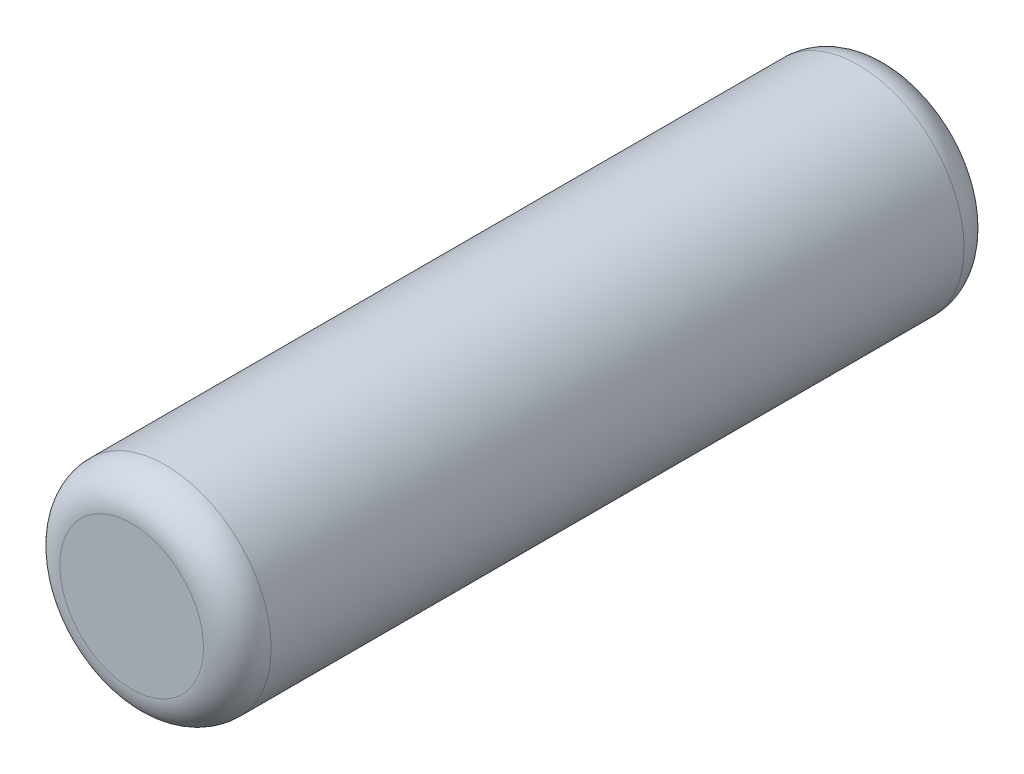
ISO-10303-21;
HEADER;
FILE_DESCRIPTION(('STEP AP214'),'2;1');
FILE_NAME('part.step','',(''),(''),'','','');
FILE_SCHEMA(('AUTOMOTIVE_DESIGN { 1 0 10303 214 1 1 1 1 }'));
ENDSEC;
DATA;
#1=APPLICATION_CONTEXT('core data for automotive mechanical design processes');
#2=APPLICATION_PROTOCOL_DEFINITION('international standard','automotive_design',2000,#1);
#3=PRODUCT_CONTEXT('',#1,'mechanical');
#4=PRODUCT('Part','Part','',(#3));
#5=PRODUCT_RELATED_PRODUCT_CATEGORY('part','',(#4));
#6=PRODUCT_DEFINITION_FORMATION('','',#4);
#7=PRODUCT_DEFINITION_CONTEXT('part definition',#1,'design');
#8=PRODUCT_DEFINITION('design','',#6,#7);
#9=PRODUCT_DEFINITION_SHAPE('','',#8);
#10=(LENGTH_UNIT() NAMED_UNIT(*) SI_UNIT(.MILLI.,.METRE.));
#11=(NAMED_UNIT(*) PLANE_ANGLE_UNIT() SI_UNIT($,.RADIAN.));
#12=(NAMED_UNIT(*) SI_UNIT($,.STERADIAN.) SOLID_ANGLE_UNIT());
#13=UNCERTAINTY_MEASURE_WITH_UNIT(LENGTH_MEASURE(1.E-05),#10,'distance_accuracy_value','');
#14=(GEOMETRIC_REPRESENTATION_CONTEXT(3) GLOBAL_UNCERTAINTY_ASSIGNED_CONTEXT((#13)) GLOBAL_UNIT_ASSIGNED_CONTEXT((#10,
#11,#12)) REPRESENTATION_CONTEXT('',''));
#15=CARTESIAN_POINT('',(0.,0.,0.));
#16=DIRECTION('',(0.,0.,1.));
#17=DIRECTION('',(1.,0.,0.));
#18=AXIS2_PLACEMENT_3D('',#15,#16,#17);
#19=CARTESIAN_POINT('',(0.,0.,-8.6));
#20=DIRECTION('',(0.,0.,1.));
#21=DIRECTION('',(1.,0.,0.));
#22=AXIS2_PLACEMENT_3D('',#19,#20,#21);
#23=TOROIDAL_SURFACE('',#22,0.850000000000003,0.399999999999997);
#24=CARTESIAN_POINT('',(0.,0.,-9.));
#25=DIRECTION('',(0.,0.,1.));
#26=DIRECTION('',(1.,0.,0.));
#27=AXIS2_PLACEMENT_3D('',#24,#25,#26);
#28=CIRCLE('',#27,0.85);
#29=CARTESIAN_POINT('',(0.85,0.,-9.));
#30=VERTEX_POINT('',#29);
#31=EDGE_CURVE('E362',#30,#30,#28,.T.);
#32=ORIENTED_EDGE('',*,*,#31,.T.);
#33=EDGE_LOOP('',(#32));
#34=FACE_BOUND('',#33,.T.);
#35=CARTESIAN_POINT('',(0.,0.,-8.6));
#36=DIRECTION('',(0.,0.,1.));
#37=DIRECTION('',(1.,0.,0.));
#38=AXIS2_PLACEMENT_3D('',#35,#36,#37);
#39=CIRCLE('',#38,1.25);
#40=CARTESIAN_POINT('',(1.25,0.,-8.6));
#41=VERTEX_POINT('',#40);
#42=EDGE_CURVE('E10',#41,#41,#39,.T.);
#43=ORIENTED_EDGE('',*,*,#42,.F.);
#44=EDGE_LOOP('',(#43));
#45=FACE_BOUND('',#44,.T.);
#46=ADVANCED_FACE('F348',(#34,#45),#23,.T.);
#47=CARTESIAN_POINT('',(0.,0.,-9.00125));
#48=DIRECTION('',(0.,0.,1.));
#49=DIRECTION('',(1.,0.,0.));
#50=AXIS2_PLACEMENT_3D('',#47,#48,#49);
#51=CYLINDRICAL_SURFACE('',#50,1.25);
#52=ORIENTED_EDGE('',*,*,#42,.T.);
#53=EDGE_LOOP('',(#52));
#54=FACE_BOUND('',#53,.T.);
#55=CARTESIAN_POINT('',(0.,0.,-0.399999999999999));
#56=DIRECTION('',(0.,0.,1.));
#57=DIRECTION('',(1.,0.,0.));
#58=AXIS2_PLACEMENT_3D('',#55,#56,#57);
#59=CIRCLE('',#58,1.25);
#60=CARTESIAN_POINT('',(1.25,0.,-0.399999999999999));
#61=VERTEX_POINT('',#60);
#62=EDGE_CURVE('E354',#61,#61,#59,.T.);
#63=ORIENTED_EDGE('',*,*,#62,.F.);
#64=EDGE_LOOP('',(#63));
#65=FACE_BOUND('',#64,.T.);
#66=ADVANCED_FACE('F381',(#54,#65),#51,.T.);
#67=CARTESIAN_POINT('',(0.,0.,-0.399999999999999));
#68=DIRECTION('',(0.,0.,1.));
#69=DIRECTION('',(1.,0.,0.));
#70=AXIS2_PLACEMENT_3D('',#67,#68,#69);
#71=TOROIDAL_SURFACE('',#70,0.85,0.4);
#72=ORIENTED_EDGE('',*,*,#62,.T.);
#73=EDGE_LOOP('',(#72));
#74=FACE_BOUND('',#73,.T.);
#75=CARTESIAN_POINT('',(0.,0.,0.));
#76=DIRECTION('',(0.,0.,1.));
#77=DIRECTION('',(1.,0.,0.));
#78=AXIS2_PLACEMENT_3D('',#75,#76,#77);
#79=CIRCLE('',#78,0.85);
#80=CARTESIAN_POINT('',(0.85,0.,0.));
#81=VERTEX_POINT('',#80);
#82=EDGE_CURVE('E358',#81,#81,#79,.T.);
#83=ORIENTED_EDGE('',*,*,#82,.F.);
#84=EDGE_LOOP('',(#83));
#85=FACE_BOUND('',#84,.T.);
#86=ADVANCED_FACE('F377',(#74,#85),#71,.T.);
#87=CARTESIAN_POINT('',(0.,0.,0.));
#88=DIRECTION('',(0.,0.,1.));
#89=DIRECTION('',(1.,0.,0.));
#90=AXIS2_PLACEMENT_3D('',#87,#88,#89);
#91=PLANE('',#90);
#92=ORIENTED_EDGE('',*,*,#82,.T.);
#93=EDGE_LOOP('',(#92));
#94=FACE_BOUND('',#93,.T.);
#95=ADVANCED_FACE('F372',(#94),#91,.T.);
#96=CARTESIAN_POINT('',(0.85,0.,-9.));
#97=DIRECTION('',(0.,0.,-1.));
#98=DIRECTION('',(-1.,0.,0.));
#99=AXIS2_PLACEMENT_3D('',#96,#97,#98);
#100=PLANE('',#99);
#101=ORIENTED_EDGE('',*,*,#31,.F.);
#102=EDGE_LOOP('',(#101));
#103=FACE_BOUND('',#102,.T.);
#104=ADVANCED_FACE('F370',(#103),#100,.T.);
#105=CLOSED_SHELL('',(#46,#66,#86,#95,#104));
#106=MANIFOLD_SOLID_BREP('B2',#105);
#107=ADVANCED_BREP_SHAPE_REPRESENTATION('',(#18,#106),#14);
#108=SHAPE_DEFINITION_REPRESENTATION(#9,#107);
ENDSEC;
END-ISO-10303-21;
